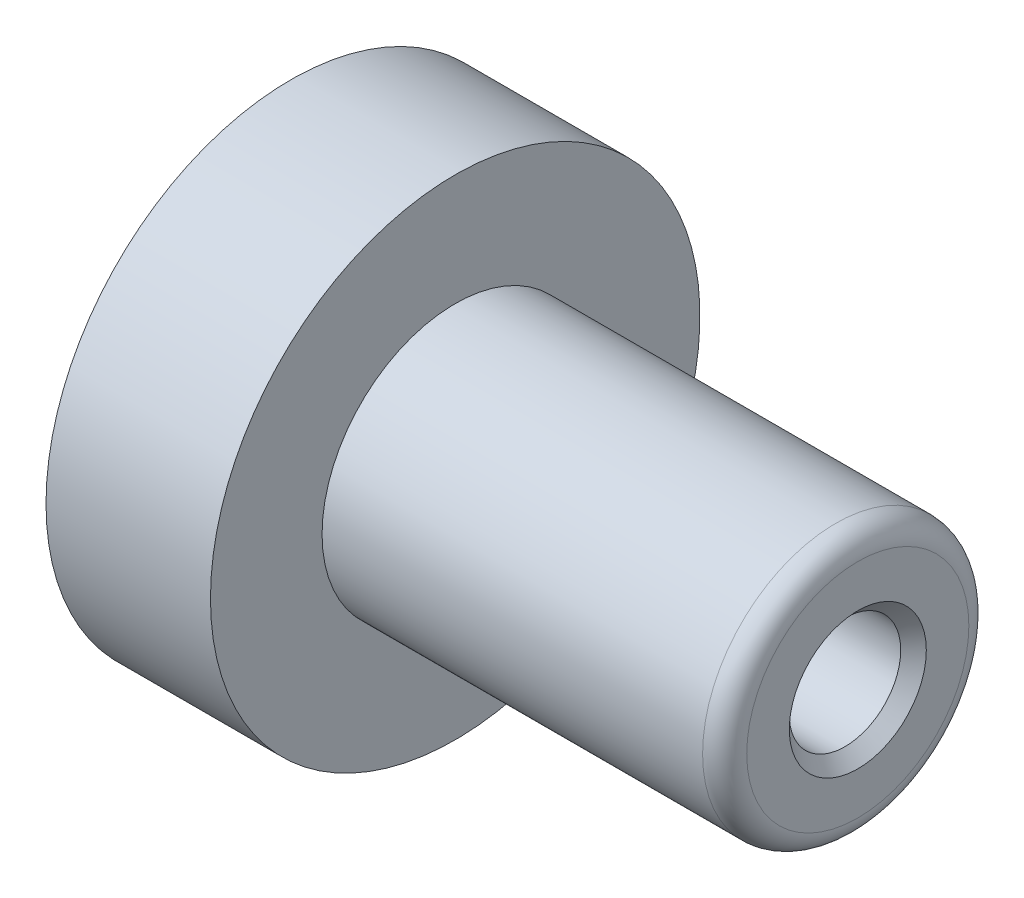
from build123d import *

# Parameters (mm, degrees)
SKETCH2_R          = 1.6129
CUT_EXTRUDE1_DEPTH = 6.35
SKETCH3_R          = 3.9751
CUT_EXTRUDE2_DEPTH = 17.4752
CHAMFER1_SIZE      = 0.9144


with BuildPart() as part:
    # Sketch1 → Revolve1 (revolve)
    with BuildSketch(Plane.XY, mode=Mode.PRIVATE) as revolve1_sk:
        with BuildLine():
            Line((0, 6.7437), (0, 17.4625))
            Line((0, 17.4625), (11.7348, 17.4625))
            Line((11.7348, 17.4625), (11.7348, 9.4996))
            Line((11.7348, 9.4996), (38.8874, 9.4996))
            ThreePointArc((38.8874, 9.4996), (40.000951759, 9.038351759), (40.4622, 7.9248))
            Line((40.4622, 7.9248), (40.4622, 0))
            Line((40.4622, 0), (20.4724, 0))
            Line((20.4724, 0), (20.4724, 6.7437))
            Line((20.4724, 6.7437), (0, 6.7437))
        make_face()
    revolve(revolve1_sk.sketch.rotate(Axis((0, 0, 0), (1, 0, 0)), 90), axis=Axis((0, 0, 0), (1, 0, 0)))

    # Sketch2 → Cut-Extrude1 (cut)
    with BuildSketch(Plane.ZY):
        with Locations((0, 11.1125)):
            Circle(SKETCH2_R)
        with Locations(Location((0, -11.1125, 0), (0, 0, 180))):
            Circle(SKETCH2_R)
    extrude(amount=-CUT_EXTRUDE1_DEPTH, mode=Mode.SUBTRACT)

    # Sketch3 → Cut-Extrude2 (cut)
    with BuildSketch(Plane(origin=(40.4622, 0, 0), x_dir=(0, 0, -1), z_dir=(1, 0, 0))):
        Circle(SKETCH3_R)
    extrude(amount=-CUT_EXTRUDE2_DEPTH, mode=Mode.SUBTRACT)

    # Chamfer1
    chamfer1_edges = [part.edges().sort_by_distance(p)[0] for p in [
        (40.4622, 0, 3.9751),
    ]]
    chamfer(chamfer1_edges, length=CHAMFER1_SIZE)


solid = part.part
